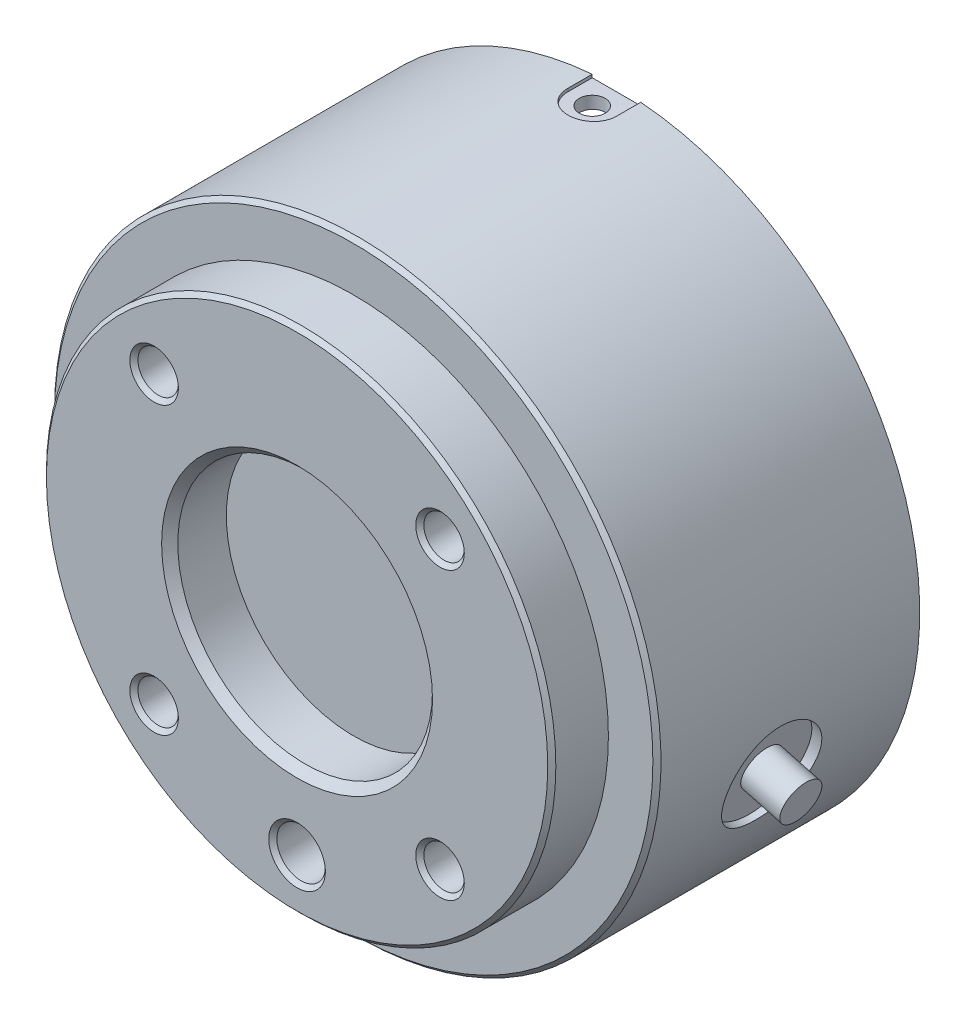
ISO-10303-21;
HEADER;
FILE_DESCRIPTION(('STEP AP214'),'2;1');
FILE_NAME('part.step','',(''),(''),'','','');
FILE_SCHEMA(('AUTOMOTIVE_DESIGN { 1 0 10303 214 1 1 1 1 }'));
ENDSEC;
DATA;
#1=APPLICATION_CONTEXT('core data for automotive mechanical design processes');
#2=APPLICATION_PROTOCOL_DEFINITION('international standard','automotive_design',2000,#1);
#3=PRODUCT_CONTEXT('',#1,'mechanical');
#4=PRODUCT('Part','Part','',(#3));
#5=PRODUCT_RELATED_PRODUCT_CATEGORY('part','',(#4));
#6=PRODUCT_DEFINITION_FORMATION('','',#4);
#7=PRODUCT_DEFINITION_CONTEXT('part definition',#1,'design');
#8=PRODUCT_DEFINITION('design','',#6,#7);
#9=PRODUCT_DEFINITION_SHAPE('','',#8);
#10=(LENGTH_UNIT() NAMED_UNIT(*) SI_UNIT(.MILLI.,.METRE.));
#11=(NAMED_UNIT(*) PLANE_ANGLE_UNIT() SI_UNIT($,.RADIAN.));
#12=(NAMED_UNIT(*) SI_UNIT($,.STERADIAN.) SOLID_ANGLE_UNIT());
#13=UNCERTAINTY_MEASURE_WITH_UNIT(LENGTH_MEASURE(1.E-05),#10,'distance_accuracy_value','');
#14=(GEOMETRIC_REPRESENTATION_CONTEXT(3) GLOBAL_UNCERTAINTY_ASSIGNED_CONTEXT((#13)) GLOBAL_UNIT_ASSIGNED_CONTEXT((#10,
#11,#12)) REPRESENTATION_CONTEXT('',''));
#15=CARTESIAN_POINT('',(0.,0.,0.));
#16=DIRECTION('',(0.,0.,1.));
#17=DIRECTION('',(1.,0.,0.));
#18=AXIS2_PLACEMENT_3D('',#15,#16,#17);
#19=CARTESIAN_POINT('',(0.,-25.,34.7));
#20=DIRECTION('',(0.,0.,1.));
#21=DIRECTION('',(1.,0.,0.));
#22=AXIS2_PLACEMENT_3D('',#19,#20,#21);
#23=PLANE('',#22);
#24=CARTESIAN_POINT('',(0.,-25.,34.7));
#25=DIRECTION('',(0.,0.,1.));
#26=DIRECTION('',(-1.,0.,0.));
#27=AXIS2_PLACEMENT_3D('',#24,#25,#26);
#28=CIRCLE('',#27,3.);
#29=CARTESIAN_POINT('',(-3.,-25.,34.7));
#30=VERTEX_POINT('',#29);
#31=EDGE_CURVE('E11',#30,#30,#28,.T.);
#32=ORIENTED_EDGE('',*,*,#31,.T.);
#33=EDGE_LOOP('',(#32));
#34=FACE_BOUND('',#33,.T.);
#35=ADVANCED_FACE('F16',(#34),#23,.T.);
#36=CARTESIAN_POINT('',(-17.6776695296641,-17.6776695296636,34.7));
#37=DIRECTION('',(0.,0.,1.));
#38=DIRECTION('',(1.,0.,0.));
#39=AXIS2_PLACEMENT_3D('',#36,#37,#38);
#40=PLANE('',#39);
#41=CARTESIAN_POINT('',(-17.6776695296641,-17.6776695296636,34.7));
#42=DIRECTION('',(0.,0.,1.));
#43=DIRECTION('',(-1.,0.,0.));
#44=AXIS2_PLACEMENT_3D('',#41,#42,#43);
#45=CIRCLE('',#44,2.49999999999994);
#46=CARTESIAN_POINT('',(-20.177669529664,-17.6776695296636,34.7));
#47=VERTEX_POINT('',#46);
#48=EDGE_CURVE('E31',#47,#47,#45,.T.);
#49=ORIENTED_EDGE('',*,*,#48,.T.);
#50=EDGE_LOOP('',(#49));
#51=FACE_BOUND('',#50,.T.);
#52=ADVANCED_FACE('F477',(#51),#40,.T.);
#53=CARTESIAN_POINT('',(17.677669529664,-17.6776695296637,34.7));
#54=DIRECTION('',(0.,0.,1.));
#55=DIRECTION('',(1.,0.,0.));
#56=AXIS2_PLACEMENT_3D('',#53,#54,#55);
#57=PLANE('',#56);
#58=CARTESIAN_POINT('',(17.677669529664,-17.6776695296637,34.7));
#59=DIRECTION('',(0.,0.,1.));
#60=DIRECTION('',(-1.,0.,0.));
#61=AXIS2_PLACEMENT_3D('',#58,#59,#60);
#62=CIRCLE('',#61,2.49999999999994);
#63=CARTESIAN_POINT('',(15.1776695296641,-17.6776695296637,34.7));
#64=VERTEX_POINT('',#63);
#65=EDGE_CURVE('E339',#64,#64,#62,.T.);
#66=ORIENTED_EDGE('',*,*,#65,.T.);
#67=EDGE_LOOP('',(#66));
#68=FACE_BOUND('',#67,.T.);
#69=ADVANCED_FACE('F474',(#68),#57,.T.);
#70=CARTESIAN_POINT('',(17.677669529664,17.6776695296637,34.7));
#71=DIRECTION('',(0.,0.,1.));
#72=DIRECTION('',(1.,0.,0.));
#73=AXIS2_PLACEMENT_3D('',#70,#71,#72);
#74=PLANE('',#73);
#75=CARTESIAN_POINT('',(17.677669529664,17.6776695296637,34.7));
#76=DIRECTION('',(0.,0.,1.));
#77=DIRECTION('',(-1.,0.,0.));
#78=AXIS2_PLACEMENT_3D('',#75,#76,#77);
#79=CIRCLE('',#78,2.49999999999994);
#80=CARTESIAN_POINT('',(15.1776695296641,17.6776695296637,34.7));
#81=VERTEX_POINT('',#80);
#82=EDGE_CURVE('E335',#81,#81,#79,.T.);
#83=ORIENTED_EDGE('',*,*,#82,.T.);
#84=EDGE_LOOP('',(#83));
#85=FACE_BOUND('',#84,.T.);
#86=ADVANCED_FACE('F470',(#85),#74,.T.);
#87=CARTESIAN_POINT('',(-17.6776695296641,17.6776695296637,34.7));
#88=DIRECTION('',(0.,0.,1.));
#89=DIRECTION('',(1.,0.,0.));
#90=AXIS2_PLACEMENT_3D('',#87,#88,#89);
#91=PLANE('',#90);
#92=CARTESIAN_POINT('',(-17.6776695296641,17.6776695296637,34.7));
#93=DIRECTION('',(0.,0.,1.));
#94=DIRECTION('',(-1.,0.,0.));
#95=AXIS2_PLACEMENT_3D('',#92,#93,#94);
#96=CIRCLE('',#95,2.49999999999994);
#97=CARTESIAN_POINT('',(-20.177669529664,17.6776695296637,34.7));
#98=VERTEX_POINT('',#97);
#99=EDGE_CURVE('E331',#98,#98,#96,.T.);
#100=ORIENTED_EDGE('',*,*,#99,.T.);
#101=EDGE_LOOP('',(#100));
#102=FACE_BOUND('',#101,.T.);
#103=ADVANCED_FACE('F466',(#102),#91,.T.);
#104=CARTESIAN_POINT('',(0.,0.,34.2));
#105=DIRECTION('',(0.,0.,1.));
#106=DIRECTION('',(1.,0.,0.));
#107=AXIS2_PLACEMENT_3D('',#104,#105,#106);
#108=PLANE('',#107);
#109=CARTESIAN_POINT('',(0.,0.,34.2));
#110=DIRECTION('',(0.,0.,1.));
#111=DIRECTION('',(1.,0.,0.));
#112=AXIS2_PLACEMENT_3D('',#109,#110,#111);
#113=CIRCLE('',#112,15.75);
#114=CARTESIAN_POINT('',(15.75,0.,34.2));
#115=VERTEX_POINT('',#114);
#116=EDGE_CURVE('E330',#115,#115,#113,.T.);
#117=ORIENTED_EDGE('',*,*,#116,.T.);
#118=EDGE_LOOP('',(#117));
#119=FACE_BOUND('',#118,.T.);
#120=ADVANCED_FACE('F462',(#119),#108,.T.);
#121=CARTESIAN_POINT('',(0.,-25.,41.2));
#122=DIRECTION('',(0.,0.,-1.));
#123=DIRECTION('',(-1.,0.,0.));
#124=AXIS2_PLACEMENT_3D('',#121,#122,#123);
#125=CYLINDRICAL_SURFACE('',#124,3.);
#126=ORIENTED_EDGE('',*,*,#31,.F.);
#127=EDGE_LOOP('',(#126));
#128=FACE_BOUND('',#127,.T.);
#129=CARTESIAN_POINT('',(0.,-25.,40.7000000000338));
#130=DIRECTION('',(0.,0.,1.));
#131=DIRECTION('',(-1.,0.,0.));
#132=AXIS2_PLACEMENT_3D('',#129,#130,#131);
#133=CIRCLE('',#132,2.99999999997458);
#134=CARTESIAN_POINT('',(-2.99999999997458,-25.,40.7000000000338));
#135=VERTEX_POINT('',#134);
#136=EDGE_CURVE('E326',#135,#135,#133,.T.);
#137=ORIENTED_EDGE('',*,*,#136,.T.);
#138=EDGE_LOOP('',(#137));
#139=FACE_BOUND('',#138,.T.);
#140=ADVANCED_FACE('F458',(#128,#139),#125,.F.);
#141=CARTESIAN_POINT('',(-17.6776695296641,-17.6776695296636,41.2));
#142=DIRECTION('',(0.,0.,-1.));
#143=DIRECTION('',(-1.,0.,0.));
#144=AXIS2_PLACEMENT_3D('',#141,#142,#143);
#145=CYLINDRICAL_SURFACE('',#144,2.49999999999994);
#146=ORIENTED_EDGE('',*,*,#48,.F.);
#147=EDGE_LOOP('',(#146));
#148=FACE_BOUND('',#147,.T.);
#149=CARTESIAN_POINT('',(-17.6776695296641,-17.6776695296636,40.6999999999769));
#150=DIRECTION('',(0.,0.,1.));
#151=DIRECTION('',(-1.,0.,0.));
#152=AXIS2_PLACEMENT_3D('',#149,#150,#151);
#153=CIRCLE('',#152,2.50000000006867);
#154=CARTESIAN_POINT('',(-20.1776695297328,-17.6776695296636,40.6999999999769));
#155=VERTEX_POINT('',#154);
#156=EDGE_CURVE('E322',#155,#155,#153,.T.);
#157=ORIENTED_EDGE('',*,*,#156,.T.);
#158=EDGE_LOOP('',(#157));
#159=FACE_BOUND('',#158,.T.);
#160=ADVANCED_FACE('F454',(#148,#159),#145,.F.);
#161=CARTESIAN_POINT('',(17.677669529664,-17.6776695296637,41.2));
#162=DIRECTION('',(0.,0.,-1.));
#163=DIRECTION('',(-1.,0.,0.));
#164=AXIS2_PLACEMENT_3D('',#161,#162,#163);
#165=CYLINDRICAL_SURFACE('',#164,2.49999999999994);
#166=ORIENTED_EDGE('',*,*,#65,.F.);
#167=EDGE_LOOP('',(#166));
#168=FACE_BOUND('',#167,.T.);
#169=CARTESIAN_POINT('',(17.677669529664,-17.6776695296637,40.6999999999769));
#170=DIRECTION('',(0.,0.,1.));
#171=DIRECTION('',(-1.,0.,0.));
#172=AXIS2_PLACEMENT_3D('',#169,#170,#171);
#173=CIRCLE('',#172,2.50000000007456);
#174=CARTESIAN_POINT('',(15.1776695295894,-17.6776695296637,40.6999999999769));
#175=VERTEX_POINT('',#174);
#176=EDGE_CURVE('E318',#175,#175,#173,.T.);
#177=ORIENTED_EDGE('',*,*,#176,.T.);
#178=EDGE_LOOP('',(#177));
#179=FACE_BOUND('',#178,.T.);
#180=ADVANCED_FACE('F450',(#168,#179),#165,.F.);
#181=CARTESIAN_POINT('',(17.677669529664,17.6776695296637,41.2));
#182=DIRECTION('',(0.,0.,-1.));
#183=DIRECTION('',(-1.,0.,0.));
#184=AXIS2_PLACEMENT_3D('',#181,#182,#183);
#185=CYLINDRICAL_SURFACE('',#184,2.49999999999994);
#186=ORIENTED_EDGE('',*,*,#82,.F.);
#187=EDGE_LOOP('',(#186));
#188=FACE_BOUND('',#187,.T.);
#189=CARTESIAN_POINT('',(17.677669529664,17.6776695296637,40.6999999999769));
#190=DIRECTION('',(0.,0.,1.));
#191=DIRECTION('',(-1.,0.,0.));
#192=AXIS2_PLACEMENT_3D('',#189,#190,#191);
#193=CIRCLE('',#192,2.50000000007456);
#194=CARTESIAN_POINT('',(15.1776695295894,17.6776695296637,40.6999999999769));
#195=VERTEX_POINT('',#194);
#196=EDGE_CURVE('E311',#195,#195,#193,.T.);
#197=ORIENTED_EDGE('',*,*,#196,.T.);
#198=EDGE_LOOP('',(#197));
#199=FACE_BOUND('',#198,.T.);
#200=ADVANCED_FACE('F446',(#188,#199),#185,.F.);
#201=CARTESIAN_POINT('',(-17.6776695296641,17.6776695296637,41.2));
#202=DIRECTION('',(0.,0.,-1.));
#203=DIRECTION('',(-1.,0.,0.));
#204=AXIS2_PLACEMENT_3D('',#201,#202,#203);
#205=CYLINDRICAL_SURFACE('',#204,2.49999999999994);
#206=ORIENTED_EDGE('',*,*,#99,.F.);
#207=EDGE_LOOP('',(#206));
#208=FACE_BOUND('',#207,.T.);
#209=CARTESIAN_POINT('',(-17.6776695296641,17.6776695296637,40.6999999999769));
#210=DIRECTION('',(0.,0.,1.));
#211=DIRECTION('',(-1.,0.,0.));
#212=AXIS2_PLACEMENT_3D('',#209,#210,#211);
#213=CIRCLE('',#212,2.50000000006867);
#214=CARTESIAN_POINT('',(-20.1776695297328,17.6776695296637,40.6999999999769));
#215=VERTEX_POINT('',#214);
#216=EDGE_CURVE('E307',#215,#215,#213,.T.);
#217=ORIENTED_EDGE('',*,*,#216,.T.);
#218=EDGE_LOOP('',(#217));
#219=FACE_BOUND('',#218,.T.);
#220=ADVANCED_FACE('F442',(#208,#219),#205,.F.);
#221=CARTESIAN_POINT('',(0.,0.,41.2));
#222=DIRECTION('',(0.,0.,-1.));
#223=DIRECTION('',(-1.,0.,0.));
#224=AXIS2_PLACEMENT_3D('',#221,#222,#223);
#225=CYLINDRICAL_SURFACE('',#224,15.75);
#226=ORIENTED_EDGE('',*,*,#116,.F.);
#227=EDGE_LOOP('',(#226));
#228=FACE_BOUND('',#227,.T.);
#229=CARTESIAN_POINT('',(0.,0.,40.2));
#230=DIRECTION('',(0.,0.,1.));
#231=DIRECTION('',(1.,0.,0.));
#232=AXIS2_PLACEMENT_3D('',#229,#230,#231);
#233=CIRCLE('',#232,15.75);
#234=CARTESIAN_POINT('',(15.75,0.,40.2));
#235=VERTEX_POINT('',#234);
#236=EDGE_CURVE('E224',#235,#235,#233,.T.);
#237=ORIENTED_EDGE('',*,*,#236,.T.);
#238=EDGE_LOOP('',(#237));
#239=FACE_BOUND('',#238,.T.);
#240=ADVANCED_FACE('F438',(#228,#239),#225,.F.);
#241=CARTESIAN_POINT('',(0.,-25.,41.2000000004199));
#242=DIRECTION('',(0.,0.,1.));
#243=DIRECTION('',(1.,0.,0.));
#244=AXIS2_PLACEMENT_3D('',#241,#242,#243);
#245=CONICAL_SURFACE('',#244,3.49999999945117,0.785398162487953);
#246=ORIENTED_EDGE('',*,*,#136,.F.);
#247=EDGE_LOOP('',(#246));
#248=FACE_BOUND('',#247,.T.);
#249=CARTESIAN_POINT('',(0.,-25.,41.2000000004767));
#250=DIRECTION('',(0.,0.,-1.));
#251=DIRECTION('',(1.,0.,0.));
#252=AXIS2_PLACEMENT_3D('',#249,#250,#251);
#253=CIRCLE('',#252,3.49999999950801);
#254=CARTESIAN_POINT('',(3.49999999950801,-25.,41.2000000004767));
#255=VERTEX_POINT('',#254);
#256=EDGE_CURVE('E296',#255,#255,#253,.T.);
#257=ORIENTED_EDGE('',*,*,#256,.F.);
#258=EDGE_LOOP('',(#257));
#259=FACE_BOUND('',#258,.T.);
#260=ADVANCED_FACE('F434',(#248,#259),#245,.F.);
#261=CARTESIAN_POINT('',(-17.6776695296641,-17.6776695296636,41.2000000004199));
#262=DIRECTION('',(0.,0.,1.));
#263=DIRECTION('',(1.,0.,0.));
#264=AXIS2_PLACEMENT_3D('',#261,#262,#263);
#265=CONICAL_SURFACE('',#264,2.9999999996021,0.785398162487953);
#266=ORIENTED_EDGE('',*,*,#156,.F.);
#267=EDGE_LOOP('',(#266));
#268=FACE_BOUND('',#267,.T.);
#269=CARTESIAN_POINT('',(-17.6776695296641,-17.6776695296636,41.2000000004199));
#270=DIRECTION('',(0.,0.,-1.));
#271=DIRECTION('',(1.,0.,0.));
#272=AXIS2_PLACEMENT_3D('',#269,#270,#271);
#273=CIRCLE('',#272,2.9999999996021);
#274=CARTESIAN_POINT('',(-14.677669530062,-17.6776695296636,41.2000000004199));
#275=VERTEX_POINT('',#274);
#276=EDGE_CURVE('E300',#275,#275,#273,.T.);
#277=ORIENTED_EDGE('',*,*,#276,.F.);
#278=EDGE_LOOP('',(#277));
#279=FACE_BOUND('',#278,.T.);
#280=ADVANCED_FACE('F430',(#268,#279),#265,.F.);
#281=CARTESIAN_POINT('',(17.677669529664,-17.6776695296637,41.2000000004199));
#282=DIRECTION('',(0.,0.,1.));
#283=DIRECTION('',(1.,0.,0.));
#284=AXIS2_PLACEMENT_3D('',#281,#282,#283);
#285=CONICAL_SURFACE('',#284,2.99999999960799,0.785398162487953);
#286=ORIENTED_EDGE('',*,*,#176,.F.);
#287=EDGE_LOOP('',(#286));
#288=FACE_BOUND('',#287,.T.);
#289=CARTESIAN_POINT('',(17.677669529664,-17.6776695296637,41.2000000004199));
#290=DIRECTION('',(0.,0.,-1.));
#291=DIRECTION('',(1.,0.,0.));
#292=AXIS2_PLACEMENT_3D('',#289,#290,#291);
#293=CIRCLE('',#292,2.99999999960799);
#294=CARTESIAN_POINT('',(20.677669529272,-17.6776695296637,41.2000000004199));
#295=VERTEX_POINT('',#294);
#296=EDGE_CURVE('E225',#295,#295,#293,.T.);
#297=ORIENTED_EDGE('',*,*,#296,.F.);
#298=EDGE_LOOP('',(#297));
#299=FACE_BOUND('',#298,.T.);
#300=ADVANCED_FACE('F426',(#288,#299),#285,.F.);
#301=CARTESIAN_POINT('',(17.677669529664,17.6776695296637,41.2000000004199));
#302=DIRECTION('',(0.,0.,1.));
#303=DIRECTION('',(1.,0.,0.));
#304=AXIS2_PLACEMENT_3D('',#301,#302,#303);
#305=CONICAL_SURFACE('',#304,2.99999999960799,0.785398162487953);
#306=ORIENTED_EDGE('',*,*,#196,.F.);
#307=EDGE_LOOP('',(#306));
#308=FACE_BOUND('',#307,.T.);
#309=CARTESIAN_POINT('',(17.677669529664,17.6776695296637,41.2000000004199));
#310=DIRECTION('',(0.,0.,-1.));
#311=DIRECTION('',(1.,0.,0.));
#312=AXIS2_PLACEMENT_3D('',#309,#310,#311);
#313=CIRCLE('',#312,2.99999999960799);
#314=CARTESIAN_POINT('',(20.677669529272,17.6776695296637,41.2000000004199));
#315=VERTEX_POINT('',#314);
#316=EDGE_CURVE('E220',#315,#315,#313,.T.);
#317=ORIENTED_EDGE('',*,*,#316,.F.);
#318=EDGE_LOOP('',(#317));
#319=FACE_BOUND('',#318,.T.);
#320=ADVANCED_FACE('F422',(#308,#319),#305,.F.);
#321=CARTESIAN_POINT('',(-17.6776695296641,17.6776695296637,41.2000000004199));
#322=DIRECTION('',(0.,0.,1.));
#323=DIRECTION('',(1.,0.,0.));
#324=AXIS2_PLACEMENT_3D('',#321,#322,#323);
#325=CONICAL_SURFACE('',#324,2.9999999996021,0.785398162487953);
#326=ORIENTED_EDGE('',*,*,#216,.F.);
#327=EDGE_LOOP('',(#326));
#328=FACE_BOUND('',#327,.T.);
#329=CARTESIAN_POINT('',(-17.6776695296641,17.6776695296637,41.2000000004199));
#330=DIRECTION('',(0.,0.,-1.));
#331=DIRECTION('',(1.,0.,0.));
#332=AXIS2_PLACEMENT_3D('',#329,#330,#331);
#333=CIRCLE('',#332,2.9999999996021);
#334=CARTESIAN_POINT('',(-14.677669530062,17.6776695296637,41.2000000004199));
#335=VERTEX_POINT('',#334);
#336=EDGE_CURVE('E530',#335,#335,#333,.T.);
#337=ORIENTED_EDGE('',*,*,#336,.F.);
#338=EDGE_LOOP('',(#337));
#339=FACE_BOUND('',#338,.T.);
#340=ADVANCED_FACE('F418',(#328,#339),#325,.F.);
#341=CARTESIAN_POINT('',(0.,0.,41.2));
#342=DIRECTION('',(0.,0.,1.));
#343=DIRECTION('',(1.,0.,0.));
#344=AXIS2_PLACEMENT_3D('',#341,#342,#343);
#345=CONICAL_SURFACE('',#344,16.75,0.785398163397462);
#346=ORIENTED_EDGE('',*,*,#236,.F.);
#347=EDGE_LOOP('',(#346));
#348=FACE_BOUND('',#347,.T.);
#349=CARTESIAN_POINT('',(0.,0.,41.2));
#350=DIRECTION('',(0.,0.,-1.));
#351=DIRECTION('',(1.,0.,0.));
#352=AXIS2_PLACEMENT_3D('',#349,#350,#351);
#353=CIRCLE('',#352,16.75);
#354=CARTESIAN_POINT('',(16.75,0.,41.2));
#355=VERTEX_POINT('',#354);
#356=EDGE_CURVE('E531',#355,#355,#353,.T.);
#357=ORIENTED_EDGE('',*,*,#356,.F.);
#358=EDGE_LOOP('',(#357));
#359=FACE_BOUND('',#358,.T.);
#360=ADVANCED_FACE('F374',(#348,#359),#345,.F.);
#361=CARTESIAN_POINT('',(39.79614404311,-10.6633446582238,18.7));
#362=DIRECTION('',(0.965925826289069,-0.258819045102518,0.));
#363=DIRECTION('',(0.,0.,-1.));
#364=AXIS2_PLACEMENT_3D('',#361,#362,#363);
#365=PLANE('',#364);
#366=CARTESIAN_POINT('',(39.79614404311,-10.6633446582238,18.7));
#367=DIRECTION('',(0.965925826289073,-0.258819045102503,0.));
#368=DIRECTION('',(0.258819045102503,0.965925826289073,0.));
#369=AXIS2_PLACEMENT_3D('',#366,#367,#368);
#370=CIRCLE('',#369,2.52499999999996);
#371=CARTESIAN_POINT('',(40.4496621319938,-8.22438194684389,18.7));
#372=VERTEX_POINT('',#371);
#373=EDGE_CURVE('E248',#372,#372,#370,.T.);
#374=ORIENTED_EDGE('',*,*,#373,.T.);
#375=EDGE_LOOP('',(#374));
#376=FACE_BOUND('',#375,.T.);
#377=ADVANCED_FACE('F369',(#376),#365,.T.);
#378=CARTESIAN_POINT('',(0.,0.,40.6999999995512));
#379=DIRECTION('',(0.,0.,-1.));
#380=DIRECTION('',(-1.,0.,0.));
#381=AXIS2_PLACEMENT_3D('',#378,#379,#380);
#382=CONICAL_SURFACE('',#381,31.4999999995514,0.7853981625);
#383=CARTESIAN_POINT('',(0.,0.,41.2));
#384=DIRECTION('',(0.,0.,-1.));
#385=DIRECTION('',(-1.,0.,0.));
#386=AXIS2_PLACEMENT_3D('',#383,#384,#385);
#387=CIRCLE('',#386,31.);
#388=CARTESIAN_POINT('',(-31.,0.,41.2));
#389=VERTEX_POINT('',#388);
#390=EDGE_CURVE('E527',#389,#389,#387,.T.);
#391=ORIENTED_EDGE('',*,*,#390,.T.);
#392=EDGE_LOOP('',(#391));
#393=FACE_BOUND('',#392,.T.);
#394=CARTESIAN_POINT('',(0.,0.,40.7));
#395=DIRECTION('',(0.,0.,-1.));
#396=DIRECTION('',(1.,0.,0.));
#397=AXIS2_PLACEMENT_3D('',#394,#395,#396);
#398=CIRCLE('',#397,31.5);
#399=CARTESIAN_POINT('',(31.5,0.,40.7));
#400=VERTEX_POINT('',#399);
#401=EDGE_CURVE('E200',#400,#400,#398,.T.);
#402=ORIENTED_EDGE('',*,*,#401,.F.);
#403=EDGE_LOOP('',(#402));
#404=FACE_BOUND('',#403,.T.);
#405=ADVANCED_FACE('F373',(#393,#404),#382,.T.);
#406=CARTESIAN_POINT('',(34.0005890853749,-9.11043038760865,18.7));
#407=DIRECTION('',(0.965925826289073,-0.258819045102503,0.));
#408=DIRECTION('',(0.258819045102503,0.965925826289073,0.));
#409=AXIS2_PLACEMENT_3D('',#406,#407,#408);
#410=CYLINDRICAL_SURFACE('',#409,2.52499999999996);
#411=ORIENTED_EDGE('',*,*,#373,.F.);
#412=EDGE_LOOP('',(#411));
#413=FACE_BOUND('',#412,.T.);
#414=CARTESIAN_POINT('',(34.9665149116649,-9.36924943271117,18.7));
#415=DIRECTION('',(0.965925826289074,-0.258819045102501,0.));
#416=DIRECTION('',(0.258819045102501,0.965925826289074,0.));
#417=AXIS2_PLACEMENT_3D('',#414,#415,#416);
#418=CIRCLE('',#417,2.525);
#419=CARTESIAN_POINT('',(35.6200330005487,-6.93028672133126,18.7));
#420=VERTEX_POINT('',#419);
#421=EDGE_CURVE('E196',#420,#420,#418,.T.);
#422=ORIENTED_EDGE('',*,*,#421,.T.);
#423=EDGE_LOOP('',(#422));
#424=FACE_BOUND('',#423,.T.);
#425=ADVANCED_FACE('F408',(#413,#424),#410,.T.);
#426=CARTESIAN_POINT('',(0.,0.,34.2));
#427=DIRECTION('',(0.,0.,1.));
#428=DIRECTION('',(1.,0.,0.));
#429=AXIS2_PLACEMENT_3D('',#426,#427,#428);
#430=CYLINDRICAL_SURFACE('',#429,31.5);
#431=CARTESIAN_POINT('',(0.,0.,34.2));
#432=DIRECTION('',(0.,0.,1.));
#433=DIRECTION('',(1.,0.,0.));
#434=AXIS2_PLACEMENT_3D('',#431,#432,#433);
#435=CIRCLE('',#434,31.5);
#436=CARTESIAN_POINT('',(31.5,0.,34.2));
#437=VERTEX_POINT('',#436);
#438=EDGE_CURVE('E201',#437,#437,#435,.T.);
#439=ORIENTED_EDGE('',*,*,#438,.T.);
#440=EDGE_LOOP('',(#439));
#441=FACE_BOUND('',#440,.T.);
#442=ORIENTED_EDGE('',*,*,#401,.T.);
#443=EDGE_LOOP('',(#442));
#444=FACE_BOUND('',#443,.T.);
#445=ADVANCED_FACE('F404',(#441,#444),#430,.T.);
#446=CARTESIAN_POINT('',(34.9665149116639,-9.36924943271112,18.7));
#447=DIRECTION('',(-0.965925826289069,0.258819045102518,0.));
#448=DIRECTION('',(0.,0.,1.));
#449=AXIS2_PLACEMENT_3D('',#446,#447,#448);
#450=PLANE('',#449);
#451=ORIENTED_EDGE('',*,*,#421,.F.);
#452=EDGE_LOOP('',(#451));
#453=FACE_BOUND('',#452,.T.);
#454=CARTESIAN_POINT('',(34.9665149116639,-9.36924943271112,18.7));
#455=DIRECTION('',(-0.965925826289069,0.258819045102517,0.));
#456=DIRECTION('',(-0.258819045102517,-0.965925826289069,0.));
#457=AXIS2_PLACEMENT_3D('',#454,#455,#456);
#458=CIRCLE('',#457,6.);
#459=CARTESIAN_POINT('',(33.4136006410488,-15.1648043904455,18.7));
#460=VERTEX_POINT('',#459);
#461=EDGE_CURVE('E286',#460,#460,#458,.T.);
#462=ORIENTED_EDGE('',*,*,#461,.F.);
#463=EDGE_LOOP('',(#462));
#464=FACE_BOUND('',#463,.T.);
#465=ADVANCED_FACE('F400',(#453,#464),#450,.F.);
#466=CARTESIAN_POINT('',(0.,0.,34.2));
#467=DIRECTION('',(0.,0.,-1.));
#468=DIRECTION('',(0.,-1.,0.));
#469=AXIS2_PLACEMENT_3D('',#466,#467,#468);
#470=PLANE('',#469);
#471=ORIENTED_EDGE('',*,*,#438,.F.);
#472=EDGE_LOOP('',(#471));
#473=FACE_BOUND('',#472,.T.);
#474=CARTESIAN_POINT('',(0.,0.,34.2));
#475=DIRECTION('',(0.,0.,1.));
#476=DIRECTION('',(-1.,0.,0.));
#477=AXIS2_PLACEMENT_3D('',#474,#475,#476);
#478=CIRCLE('',#477,37.);
#479=CARTESIAN_POINT('',(-37.,0.,34.2));
#480=VERTEX_POINT('',#479);
#481=EDGE_CURVE('E282',#480,#480,#478,.T.);
#482=ORIENTED_EDGE('',*,*,#481,.T.);
#483=EDGE_LOOP('',(#482));
#484=FACE_BOUND('',#483,.T.);
#485=ADVANCED_FACE('F397',(#473,#484),#470,.F.);
#486=CARTESIAN_POINT('',(44.625773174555,-11.9574398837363,18.7));
#487=DIRECTION('',(-0.965925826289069,0.258819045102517,0.));
#488=DIRECTION('',(-0.258819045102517,-0.965925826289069,0.));
#489=AXIS2_PLACEMENT_3D('',#486,#487,#488);
#490=CYLINDRICAL_SURFACE('',#489,6.);
#491=CARTESIAN_POINT('',(34.2026538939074,-15.376230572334,18.7));
#492=CARTESIAN_POINT('',(34.2026522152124,-15.3762326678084,18.8674077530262));
#493=CARTESIAN_POINT('',(34.2055669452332,-15.3697553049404,19.034781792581));
#494=CARTESIAN_POINT('',(34.217176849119,-15.343892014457,19.3683795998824));
#495=CARTESIAN_POINT('',(34.2258731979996,-15.3245034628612,19.534603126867));
#496=CARTESIAN_POINT('',(34.2489199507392,-15.2729262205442,19.8647613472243));
#497=CARTESIAN_POINT('',(34.2632740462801,-15.2407291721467,20.0286944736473));
#498=CARTESIAN_POINT('',(34.2974180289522,-15.1637359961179,20.3530617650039));
#499=CARTESIAN_POINT('',(34.317209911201,-15.1189352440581,20.5134946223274));
#500=CARTESIAN_POINT('',(34.3618970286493,-15.0170941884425,20.8294810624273));
#501=CARTESIAN_POINT('',(34.3867861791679,-14.9600684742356,20.9850402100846));
#502=CARTESIAN_POINT('',(34.4413193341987,-14.8340902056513,21.2904564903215));
#503=CARTESIAN_POINT('',(34.4709650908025,-14.7651332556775,21.4403114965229));
#504=CARTESIAN_POINT('',(34.5345553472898,-14.6157814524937,21.7331568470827));
#505=CARTESIAN_POINT('',(34.568497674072,-14.5353923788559,21.8761506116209));
#506=CARTESIAN_POINT('',(34.6402237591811,-14.363619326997,22.1544349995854));
#507=CARTESIAN_POINT('',(34.6780089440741,-14.272231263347,22.2897227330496));
#508=CARTESIAN_POINT('',(34.7571956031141,-14.0782955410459,22.5526419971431));
#509=CARTESIAN_POINT('',(34.7986228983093,-13.9756666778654,22.6802058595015));
#510=CARTESIAN_POINT('',(34.8842915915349,-13.7604366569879,22.9256936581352));
#511=CARTESIAN_POINT('',(34.9285340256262,-13.6478318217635,23.0436140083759));
#512=CARTESIAN_POINT('',(35.0192229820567,-13.4134188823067,23.2689143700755));
#513=CARTESIAN_POINT('',(35.0656688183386,-13.291613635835,23.3762976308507));
#514=CARTESIAN_POINT('',(35.1602039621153,-13.0394856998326,23.5798547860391));
#515=CARTESIAN_POINT('',(35.2082938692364,-12.90915988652,23.6760245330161));
#516=CARTESIAN_POINT('',(35.3057606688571,-12.6401671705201,23.8568921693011));
#517=CARTESIAN_POINT('',(35.3551429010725,-12.5014608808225,23.9415286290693));
#518=CARTESIAN_POINT('',(35.4543837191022,-12.2171745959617,24.0981560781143));
#519=CARTESIAN_POINT('',(35.5042424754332,-12.071592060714,24.17014234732));
#520=CARTESIAN_POINT('',(35.6038318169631,-11.7746187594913,24.300869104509));
#521=CARTESIAN_POINT('',(35.6535624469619,-11.6232304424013,24.3596151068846));
#522=CARTESIAN_POINT('',(35.7523818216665,-11.3156257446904,24.4634716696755));
#523=CARTESIAN_POINT('',(35.8014703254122,-11.1594076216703,24.5085772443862));
#524=CARTESIAN_POINT('',(35.9461398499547,-10.6879311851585,24.622153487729));
#525=CARTESIAN_POINT('',(36.0400995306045,-10.3669620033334,24.6701510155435));
#526=CARTESIAN_POINT('',(36.2200634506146,-9.71957194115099,24.7094268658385));
#527=CARTESIAN_POINT('',(36.3060681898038,-9.39315140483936,24.7007087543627));
#528=CARTESIAN_POINT('',(36.4670813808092,-8.74709973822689,24.6272499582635));
#529=CARTESIAN_POINT('',(36.5421830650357,-8.42743382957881,24.5630215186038));
#530=CARTESIAN_POINT('',(36.6809992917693,-7.80110786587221,24.3811506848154));
#531=CARTESIAN_POINT('',(36.7447135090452,-7.4944481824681,24.2635067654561));
#532=CARTESIAN_POINT('',(36.8606606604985,-6.90169351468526,23.9776342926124));
#533=CARTESIAN_POINT('',(36.9128436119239,-6.6156915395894,23.8091927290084));
#534=CARTESIAN_POINT('',(37.0058458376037,-6.07396370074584,23.4266608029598));
#535=CARTESIAN_POINT('',(37.0466642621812,-5.8182401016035,23.2125670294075));
#536=CARTESIAN_POINT('',(37.1183648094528,-5.34188859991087,22.7419612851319));
#537=CARTESIAN_POINT('',(37.1491306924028,-5.12168521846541,22.4850016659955));
#538=CARTESIAN_POINT('',(37.2014633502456,-4.72662253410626,21.9374717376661));
#539=CARTESIAN_POINT('',(37.2230300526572,-4.55176358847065,21.6469011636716));
#540=CARTESIAN_POINT('',(37.2583727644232,-4.25281673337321,21.0399084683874));
#541=CARTESIAN_POINT('',(37.2721411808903,-4.12877833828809,20.7234614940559));
#542=CARTESIAN_POINT('',(37.2930065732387,-3.93588164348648,20.0739681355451));
#543=CARTESIAN_POINT('',(37.3001040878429,-3.86701888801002,19.7409230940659));
#544=CARTESIAN_POINT('',(37.3082836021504,-3.78729270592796,19.0716165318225));
#545=CARTESIAN_POINT('',(37.3094310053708,-3.77579873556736,18.7354308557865));
#546=CARTESIAN_POINT('',(37.3060046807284,-3.80950004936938,18.0659531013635));
#547=CARTESIAN_POINT('',(37.3014311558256,-3.85469332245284,17.7326609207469));
#548=CARTESIAN_POINT('',(37.286148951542,-3.99978914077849,17.0803992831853));
#549=CARTESIAN_POINT('',(37.2754758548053,-4.09937423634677,16.7613582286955));
#550=CARTESIAN_POINT('',(37.2470853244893,-4.34976035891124,16.1443888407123));
#551=CARTESIAN_POINT('',(37.2293674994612,-4.50056423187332,15.8464616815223));
#552=CARTESIAN_POINT('',(37.1854467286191,-4.85012684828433,15.2773828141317));
#553=CARTESIAN_POINT('',(37.159172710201,-5.04928358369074,15.0064811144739));
#554=CARTESIAN_POINT('',(37.0968002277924,-5.4887657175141,14.5017218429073));
#555=CARTESIAN_POINT('',(37.0607011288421,-5.72909377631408,14.2678666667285));
#556=CARTESIAN_POINT('',(36.9770672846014,-6.24624973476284,13.8415680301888));
#557=CARTESIAN_POINT('',(36.9294267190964,-6.52340399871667,13.6495409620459));
#558=CARTESIAN_POINT('',(36.8221121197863,-7.10416067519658,13.3152612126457));
#559=CARTESIAN_POINT('',(36.7624384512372,-7.40776228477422,13.173007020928));
#560=CARTESIAN_POINT('',(36.6313177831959,-8.03103777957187,12.9429605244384));
#561=CARTESIAN_POINT('',(36.5599202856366,-8.35064031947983,12.8549463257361));
#562=CARTESIAN_POINT('',(36.4060399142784,-8.99780780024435,12.7351833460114));
#563=CARTESIAN_POINT('',(36.323557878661,-9.32537213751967,12.7034303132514));
#564=CARTESIAN_POINT('',(36.1936458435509,-9.81316606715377,12.6986920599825));
#565=CARTESIAN_POINT('',(36.1495516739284,-9.97435540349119,12.7041257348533));
#566=CARTESIAN_POINT('',(36.0595081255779,-10.29512122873,12.7289039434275));
#567=CARTESIAN_POINT('',(36.0135594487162,-10.454698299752,12.7482432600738));
#568=CARTESIAN_POINT('',(35.9201748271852,-10.7711791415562,12.8007011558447));
#569=CARTESIAN_POINT('',(35.8727383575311,-10.9280819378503,12.8338246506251));
#570=CARTESIAN_POINT('',(35.7768487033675,-11.2380335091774,12.9135826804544));
#571=CARTESIAN_POINT('',(35.7283958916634,-11.3910836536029,12.9602123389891));
#572=CARTESIAN_POINT('',(35.630970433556,-11.6922618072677,13.0666087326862));
#573=CARTESIAN_POINT('',(35.5819981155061,-11.8403927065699,13.1263675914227));
#574=CARTESIAN_POINT('',(35.4840404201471,-12.1308018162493,13.2585774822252));
#575=CARTESIAN_POINT('',(35.4350550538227,-12.2730821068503,13.3310239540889));
#576=CARTESIAN_POINT('',(35.337578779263,-12.5509848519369,13.4881353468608));
#577=CARTESIAN_POINT('',(35.2890880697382,-12.6866047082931,13.5728049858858));
#578=CARTESIAN_POINT('',(35.1931998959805,-12.9502258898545,13.7537141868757));
#579=CARTESIAN_POINT('',(35.1458020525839,-13.0782298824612,13.8499496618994));
#580=CARTESIAN_POINT('',(35.0521411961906,-13.3272386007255,14.0544673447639));
#581=CARTESIAN_POINT('',(35.0058963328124,-13.4481511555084,14.1628701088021));
#582=CARTESIAN_POINT('',(34.9156951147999,-13.6806352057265,14.3900523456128));
#583=CARTESIAN_POINT('',(34.8717379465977,-13.7922100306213,14.508828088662));
#584=CARTESIAN_POINT('',(34.786647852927,-14.0054389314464,14.7560472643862));
#585=CARTESIAN_POINT('',(34.7455166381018,-14.1070870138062,14.8844964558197));
#586=CARTESIAN_POINT('',(34.6666826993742,-14.2997182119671,15.1500693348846));
#587=CARTESIAN_POINT('',(34.6289787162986,-14.3907052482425,15.2871898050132));
#588=CARTESIAN_POINT('',(34.557266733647,-14.5620742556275,15.5701754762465));
#589=CARTESIAN_POINT('',(34.5232858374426,-14.6423792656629,15.7160941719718));
#590=CARTESIAN_POINT('',(34.4598299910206,-14.7911004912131,16.0147378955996));
#591=CARTESIAN_POINT('',(34.430353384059,-14.8595210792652,16.1674603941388));
#592=CARTESIAN_POINT('',(34.3763547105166,-14.9840196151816,16.4785785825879));
#593=CARTESIAN_POINT('',(34.3518291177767,-15.0401063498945,16.6369701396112));
#594=CARTESIAN_POINT('',(34.3080900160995,-15.1396137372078,16.9583415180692));
#595=CARTESIAN_POINT('',(34.2888753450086,-15.1830371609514,17.1213203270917));
#596=CARTESIAN_POINT('',(34.2494469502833,-15.2718258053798,17.5171132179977));
#597=CARTESIAN_POINT('',(34.2319436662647,-15.3109385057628,17.7516338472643));
#598=CARTESIAN_POINT('',(34.2085484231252,-15.3631391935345,18.2241257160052));
#599=CARTESIAN_POINT('',(34.2026562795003,-15.3762275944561,18.4620969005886));
#600=CARTESIAN_POINT('',(34.2026538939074,-15.376230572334,18.7));
#601=B_SPLINE_CURVE_WITH_KNOTS('',3,(#491,#492,#493,#494,#495,#496,#497,#498,#499,#500,#501,
#502,#503,#504,#505,#506,#507,#508,#509,#510,#511,#512,#513,#514,#515,#516,#517,#518,#519,#520,
#521,#522,#523,#524,#525,#526,#527,#528,#529,#530,#531,#532,#533,#534,#535,#536,#537,#538,#539,
#540,#541,#542,#543,#544,#545,#546,#547,#548,#549,#550,#551,#552,#553,#554,#555,#556,#557,#558,
#559,#560,#561,#562,#563,#564,#565,#566,#567,#568,#569,#570,#571,#572,#573,#574,#575,#576,#577,
#578,#579,#580,#581,#582,#583,#584,#585,#586,#587,#588,#589,#590,#591,#592,#593,#594,#595,#596,
#597,#598,#599,#600),.UNSPECIFIED.,.T.,.F.,(4,2,2,2,2,2,2,2,2,2,2,2,2,2,2,2,2,2,2,2,2,2,2,2,2,2,
2,2,2,2,2,2,2,2,2,2,2,2,2,2,2,2,2,2,2,2,2,2,2,2,2,2,2,2,4),(0.,0.502014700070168,
1.00413145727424,1.50657638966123,2.00920591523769,2.51123890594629,3.01345724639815,
3.51542258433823,4.01757494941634,4.52362964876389,5.02987168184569,5.53595711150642,
6.04222913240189,6.55110028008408,7.0601608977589,7.56900910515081,8.07804307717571,
9.08633347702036,10.0945604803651,11.0935817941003,12.0926316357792,13.0959304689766,
14.0993042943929,15.1139004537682,16.1285046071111,17.1440949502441,18.1596032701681,
19.1639251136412,20.1682113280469,21.1666978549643,22.1652398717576,23.172297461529,
24.1794201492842,25.1961516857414,26.2128523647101,27.2253656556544,28.2378024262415,
28.738914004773,29.239837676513,29.7409401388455,30.2418618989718,30.7424839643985,
31.2429264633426,31.743562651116,32.2440224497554,32.7499715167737,33.255739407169,
33.7618108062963,34.267695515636,34.7770475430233,35.2862117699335,35.7950120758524,
36.3037009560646,37.0171252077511,37.7305381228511),.UNSPECIFIED.);
#602=CARTESIAN_POINT('',(34.2026538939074,-15.376230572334,18.7));
#603=VERTEX_POINT('',#602);
#604=EDGE_CURVE('E343',#603,#603,#601,.F.);
#605=ORIENTED_EDGE('',*,*,#604,.T.);
#606=EDGE_LOOP('',(#605));
#607=FACE_BOUND('',#606,.T.);
#608=ORIENTED_EDGE('',*,*,#461,.T.);
#609=EDGE_LOOP('',(#608));
#610=FACE_BOUND('',#609,.T.);
#611=ADVANCED_FACE('F354',(#607,#610),#490,.F.);
#612=CARTESIAN_POINT('',(0.,0.,34.2));
#613=DIRECTION('',(0.,0.,-1.));
#614=DIRECTION('',(-1.,0.,0.));
#615=AXIS2_PLACEMENT_3D('',#612,#613,#614);
#616=CONICAL_SURFACE('',#615,37.,0.785398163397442);
#617=ORIENTED_EDGE('',*,*,#481,.F.);
#618=EDGE_LOOP('',(#617));
#619=FACE_BOUND('',#618,.T.);
#620=CARTESIAN_POINT('',(0.,0.,33.7));
#621=DIRECTION('',(0.,0.,-1.));
#622=DIRECTION('',(-1.,0.,0.));
#623=AXIS2_PLACEMENT_3D('',#620,#621,#622);
#624=CIRCLE('',#623,37.5);
#625=CARTESIAN_POINT('',(-37.5,0.,33.7));
#626=VERTEX_POINT('',#625);
#627=EDGE_CURVE('E351',#626,#626,#624,.T.);
#628=ORIENTED_EDGE('',*,*,#627,.F.);
#629=EDGE_LOOP('',(#628));
#630=FACE_BOUND('',#629,.T.);
#631=ADVANCED_FACE('F393',(#619,#630),#616,.T.);
#632=CARTESIAN_POINT('',(0.,47.,4.7));
#633=DIRECTION('',(0.,-1.,0.));
#634=DIRECTION('',(0.,0.,-1.));
#635=AXIS2_PLACEMENT_3D('',#632,#633,#634);
#636=CYLINDRICAL_SURFACE('',#635,3.00000000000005);
#637=DIRECTION('',(0.,-1.,0.));
#638=VECTOR('',#637,1.);
#639=CARTESIAN_POINT('',(3.,47.,4.7));
#640=LINE('',#639,#638);
#641=CARTESIAN_POINT('',(3.00000000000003,37.3798073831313,4.7));
#642=VERTEX_POINT('',#641);
#643=CARTESIAN_POINT('',(3.,37.,4.7));
#644=VERTEX_POINT('',#643);
#645=EDGE_CURVE('E281',#642,#644,#640,.T.);
#646=ORIENTED_EDGE('',*,*,#645,.T.);
#647=CARTESIAN_POINT('',(0.,37.,4.7));
#648=DIRECTION('',(0.,1.,0.));
#649=DIRECTION('',(0.,0.,1.));
#650=AXIS2_PLACEMENT_3D('',#647,#648,#649);
#651=CIRCLE('',#650,3.00000000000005);
#652=CARTESIAN_POINT('',(-3.,37.,4.7));
#653=VERTEX_POINT('',#652);
#654=EDGE_CURVE('E274',#653,#644,#651,.T.);
#655=ORIENTED_EDGE('',*,*,#654,.F.);
#656=DIRECTION('',(0.,-1.,0.));
#657=VECTOR('',#656,1.);
#658=CARTESIAN_POINT('',(-3.,47.,4.7));
#659=LINE('',#658,#657);
#660=CARTESIAN_POINT('',(-3.,37.3798073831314,4.7));
#661=VERTEX_POINT('',#660);
#662=EDGE_CURVE('E45',#661,#653,#659,.T.);
#663=ORIENTED_EDGE('',*,*,#662,.F.);
#664=CARTESIAN_POINT('',(3.00000000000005,37.3798073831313,4.7));
#665=CARTESIAN_POINT('',(3.00000824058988,37.379804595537,4.78423421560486));
#666=CARTESIAN_POINT('',(2.9964523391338,37.3800920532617,4.86846441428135));
#667=CARTESIAN_POINT('',(2.98227605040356,37.3812268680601,5.03631954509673));
#668=CARTESIAN_POINT('',(2.97165608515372,37.3820741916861,5.11994451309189));
#669=CARTESIAN_POINT('',(2.94342723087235,37.3843072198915,5.28593289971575));
#670=CARTESIAN_POINT('',(2.92582417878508,37.3856924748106,5.36829731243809));
#671=CARTESIAN_POINT('',(2.8837740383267,37.3889594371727,5.53122546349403));
#672=CARTESIAN_POINT('',(2.85932701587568,37.390841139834,5.61178921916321));
#673=CARTESIAN_POINT('',(2.77592538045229,37.3971576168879,5.84999192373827));
#674=CARTESIAN_POINT('',(2.70689652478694,37.4022649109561,6.00422226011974));
#675=CARTESIAN_POINT('',(2.54405287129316,37.4136928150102,6.29879865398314));
#676=CARTESIAN_POINT('',(2.45024173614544,37.4200132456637,6.43914675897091));
#677=CARTESIAN_POINT('',(2.24023851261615,37.4331723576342,6.70242979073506));
#678=CARTESIAN_POINT('',(2.12400166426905,37.4400120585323,6.82532902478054));
#679=CARTESIAN_POINT('',(1.87253318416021,37.4534303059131,7.04990384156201));
#680=CARTESIAN_POINT('',(1.7372986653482,37.4600088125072,7.15157619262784));
#681=CARTESIAN_POINT('',(1.45146409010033,37.4721724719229,7.33092241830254));
#682=CARTESIAN_POINT('',(1.30084419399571,37.4777563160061,7.40856477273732));
#683=CARTESIAN_POINT('',(0.988663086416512,37.4872899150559,7.53743887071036));
#684=CARTESIAN_POINT('',(0.827102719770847,37.491239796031,7.58867265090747));
#685=CARTESIAN_POINT('',(0.497985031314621,37.4970535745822,7.66317685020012));
#686=CARTESIAN_POINT('',(0.330441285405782,37.4989219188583,7.68650688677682));
#687=CARTESIAN_POINT('',(-0.00619786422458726,37.5003771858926,7.7047255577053));
#688=CARTESIAN_POINT('',(-0.175293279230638,37.4999640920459,7.69961398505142));
#689=CARTESIAN_POINT('',(-0.509822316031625,37.4969066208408,7.66114240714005));
#690=CARTESIAN_POINT('',(-0.675263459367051,37.4942673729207,7.62784734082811));
#691=CARTESIAN_POINT('',(-0.998200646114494,37.4870604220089,7.53405493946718));
#692=CARTESIAN_POINT('',(-1.15569665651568,37.4824927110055,7.47355749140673));
#693=CARTESIAN_POINT('',(-1.45848364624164,37.4719338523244,7.32700371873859));
#694=CARTESIAN_POINT('',(-1.60376020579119,37.4659410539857,7.24091772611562));
#695=CARTESIAN_POINT('',(-1.87781948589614,37.4532060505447,7.04565600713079));
#696=CARTESIAN_POINT('',(-2.0066026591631,37.4464638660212,6.93648091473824));
#697=CARTESIAN_POINT('',(-2.24438968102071,37.4329663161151,6.69779167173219));
#698=CARTESIAN_POINT('',(-2.35333979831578,37.4262109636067,6.56822399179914));
#699=CARTESIAN_POINT('',(-2.54798498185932,37.4134644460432,6.29255849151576));
#700=CARTESIAN_POINT('',(-2.63367286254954,37.4074735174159,6.14645558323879));
#701=CARTESIAN_POINT('',(-2.77935557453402,37.3969322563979,5.84181086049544));
#702=CARTESIAN_POINT('',(-2.83933216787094,37.3923829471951,5.6832603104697));
#703=CARTESIAN_POINT('',(-2.93170775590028,37.3852547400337,5.35841518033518));
#704=CARTESIAN_POINT('',(-2.96414860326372,37.3826728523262,5.19213275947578));
#705=CARTESIAN_POINT('',(-2.9882674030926,37.3807473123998,4.97058958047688));
#706=CARTESIAN_POINT('',(-2.9926693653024,37.3803950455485,4.91651809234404));
#707=CARTESIAN_POINT('',(-2.99853167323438,37.3799253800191,4.80830517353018));
#708=CARTESIAN_POINT('',(-2.99999690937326,37.3798075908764,4.75416400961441));
#709=CARTESIAN_POINT('',(-3.00000000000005,37.3798073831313,4.7));
#710=B_SPLINE_CURVE_WITH_KNOTS('',3,(#664,#665,#666,#667,#668,#669,#670,#671,#672,#673,#674,
#675,#676,#677,#678,#679,#680,#681,#682,#683,#684,#685,#686,#687,#688,#689,#690,#691,#692,#693,
#694,#695,#696,#697,#698,#699,#700,#701,#702,#703,#704,#705,#706,#707,#708,#709),.UNSPECIFIED.,
.F.,.F.,(4,2,2,2,2,2,2,2,2,2,2,2,2,2,2,2,2,2,2,2,2,2,4),(0.,0.25261992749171,0.50522476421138,
0.757618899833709,1.01001060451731,1.51455372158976,2.01902231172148,2.52450839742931,
3.03007138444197,3.53629473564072,4.04247904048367,4.54757991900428,5.05268447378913,
5.5566283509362,6.06057432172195,6.56510687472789,7.06962557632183,7.57549140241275,
8.0815133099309,8.58789356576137,9.09350276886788,9.25620034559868,9.41862676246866),.UNSPECIFIED.);
#711=EDGE_CURVE('E19',#642,#661,#710,.T.);
#712=ORIENTED_EDGE('',*,*,#711,.F.);
#713=EDGE_LOOP('',(#646,#655,#663,#712));
#714=FACE_BOUND('',#713,.T.);
#715=ADVANCED_FACE('F388',(#714),#636,.F.);
#716=CARTESIAN_POINT('',(-3.,47.,0.));
#717=DIRECTION('',(-1.,0.,0.));
#718=DIRECTION('',(0.,0.,1.));
#719=AXIS2_PLACEMENT_3D('',#716,#717,#718);
#720=PLANE('',#719);
#721=DIRECTION('',(0.,1.,0.));
#722=VECTOR('',#721,1.);
#723=CARTESIAN_POINT('',(-3.,0.,1.7));
#724=LINE('',#723,#722);
#725=CARTESIAN_POINT('',(-3.,37.,1.7));
#726=VERTEX_POINT('',#725);
#727=CARTESIAN_POINT('',(-3.,37.3798073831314,1.7));
#728=VERTEX_POINT('',#727);
#729=EDGE_CURVE('E264',#726,#728,#724,.T.);
#730=ORIENTED_EDGE('',*,*,#729,.T.);
#731=DIRECTION('',(0.,0.,1.));
#732=VECTOR('',#731,1.);
#733=CARTESIAN_POINT('',(-3.,37.3798073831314,7.7));
#734=LINE('',#733,#732);
#735=EDGE_CURVE('E541',#728,#661,#734,.T.);
#736=ORIENTED_EDGE('',*,*,#735,.T.);
#737=ORIENTED_EDGE('',*,*,#662,.T.);
#738=DIRECTION('',(0.,0.,-1.));
#739=VECTOR('',#738,1.);
#740=CARTESIAN_POINT('',(-3.,37.,0.));
#741=LINE('',#740,#739);
#742=EDGE_CURVE('E268',#653,#726,#741,.T.);
#743=ORIENTED_EDGE('',*,*,#742,.T.);
#744=EDGE_LOOP('',(#730,#736,#737,#743));
#745=FACE_BOUND('',#744,.T.);
#746=ADVANCED_FACE('F364',(#745),#720,.F.);
#747=CARTESIAN_POINT('',(0.,0.,7.7));
#748=DIRECTION('',(0.,0.,1.));
#749=DIRECTION('',(1.,0.,0.));
#750=AXIS2_PLACEMENT_3D('',#747,#748,#749);
#751=CYLINDRICAL_SURFACE('',#750,37.5);
#752=ORIENTED_EDGE('',*,*,#604,.F.);
#753=EDGE_LOOP('',(#752));
#754=FACE_BOUND('',#753,.T.);
#755=ORIENTED_EDGE('',*,*,#627,.T.);
#756=EDGE_LOOP('',(#755));
#757=FACE_BOUND('',#756,.T.);
#758=CARTESIAN_POINT('',(0.,0.,1.7));
#759=DIRECTION('',(0.,0.,1.));
#760=DIRECTION('',(1.,0.,0.));
#761=AXIS2_PLACEMENT_3D('',#758,#759,#760);
#762=CIRCLE('',#761,37.5);
#763=CARTESIAN_POINT('',(3.,37.3798073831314,1.7));
#764=VERTEX_POINT('',#763);
#765=EDGE_CURVE('E263',#728,#764,#762,.T.);
#766=ORIENTED_EDGE('',*,*,#765,.T.);
#767=DIRECTION('',(0.,0.,1.));
#768=VECTOR('',#767,1.);
#769=CARTESIAN_POINT('',(3.,37.3798073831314,7.7));
#770=LINE('',#769,#768);
#771=EDGE_CURVE('E352',#764,#642,#770,.T.);
#772=ORIENTED_EDGE('',*,*,#771,.T.);
#773=ORIENTED_EDGE('',*,*,#711,.T.);
#774=ORIENTED_EDGE('',*,*,#735,.F.);
#775=EDGE_LOOP('',(#766,#772,#773,#774));
#776=FACE_BOUND('',#775,.T.);
#777=ADVANCED_FACE('F358',(#754,#757,#776),#751,.T.);
#778=CARTESIAN_POINT('',(3.,47.,0.));
#779=DIRECTION('',(-1.,0.,0.));
#780=DIRECTION('',(0.,0.,1.));
#781=AXIS2_PLACEMENT_3D('',#778,#779,#780);
#782=PLANE('',#781);
#783=DIRECTION('',(0.,0.,-1.));
#784=VECTOR('',#783,1.);
#785=CARTESIAN_POINT('',(3.,37.,0.));
#786=LINE('',#785,#784);
#787=CARTESIAN_POINT('',(3.,37.,1.7));
#788=VERTEX_POINT('',#787);
#789=EDGE_CURVE('E278',#644,#788,#786,.T.);
#790=ORIENTED_EDGE('',*,*,#789,.F.);
#791=ORIENTED_EDGE('',*,*,#645,.F.);
#792=ORIENTED_EDGE('',*,*,#771,.F.);
#793=DIRECTION('',(0.,1.,0.));
#794=VECTOR('',#793,1.);
#795=CARTESIAN_POINT('',(3.,0.,1.7));
#796=LINE('',#795,#794);
#797=EDGE_CURVE('E259',#788,#764,#796,.T.);
#798=ORIENTED_EDGE('',*,*,#797,.F.);
#799=EDGE_LOOP('',(#790,#791,#792,#798));
#800=FACE_BOUND('',#799,.T.);
#801=ADVANCED_FACE('F363',(#800),#782,.T.);
#802=CARTESIAN_POINT('',(-550.,37.,0.));
#803=DIRECTION('',(0.,1.,0.));
#804=DIRECTION('',(1.,0.,0.));
#805=AXIS2_PLACEMENT_3D('',#802,#803,#804);
#806=PLANE('',#805);
#807=CARTESIAN_POINT('',(0.,37.,4.7));
#808=DIRECTION('',(0.,1.,0.));
#809=DIRECTION('',(0.,0.,1.));
#810=AXIS2_PLACEMENT_3D('',#807,#808,#809);
#811=CIRCLE('',#810,1.60000000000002);
#812=CARTESIAN_POINT('',(0.,37.,6.30000000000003));
#813=VERTEX_POINT('',#812);
#814=EDGE_CURVE('E236',#813,#813,#811,.T.);
#815=ORIENTED_EDGE('',*,*,#814,.F.);
#816=EDGE_LOOP('',(#815));
#817=FACE_BOUND('',#816,.T.);
#818=ORIENTED_EDGE('',*,*,#742,.F.);
#819=ORIENTED_EDGE('',*,*,#654,.T.);
#820=ORIENTED_EDGE('',*,*,#789,.T.);
#821=DIRECTION('',(1.,0.,0.));
#822=VECTOR('',#821,1.);
#823=CARTESIAN_POINT('',(0.,37.,1.7));
#824=LINE('',#823,#822);
#825=EDGE_CURVE('E255',#726,#788,#824,.T.);
#826=ORIENTED_EDGE('',*,*,#825,.F.);
#827=EDGE_LOOP('',(#818,#819,#820,#826));
#828=FACE_BOUND('',#827,.T.);
#829=ADVANCED_FACE('F379',(#817,#828),#806,.T.);
#830=CARTESIAN_POINT('',(0.,0.,1.7));
#831=DIRECTION('',(0.,0.,-1.));
#832=DIRECTION('',(0.,-1.,0.));
#833=AXIS2_PLACEMENT_3D('',#830,#831,#832);
#834=PLANE('',#833);
#835=CARTESIAN_POINT('',(0.,0.,1.7));
#836=DIRECTION('',(0.,0.,1.));
#837=DIRECTION('',(1.,0.,0.));
#838=AXIS2_PLACEMENT_3D('',#835,#836,#837);
#839=CIRCLE('',#838,35.5);
#840=CARTESIAN_POINT('',(35.5,0.,1.7));
#841=VERTEX_POINT('',#840);
#842=EDGE_CURVE('E207',#841,#841,#839,.T.);
#843=ORIENTED_EDGE('',*,*,#842,.T.);
#844=EDGE_LOOP('',(#843));
#845=FACE_BOUND('',#844,.T.);
#846=ORIENTED_EDGE('',*,*,#825,.T.);
#847=ORIENTED_EDGE('',*,*,#797,.T.);
#848=ORIENTED_EDGE('',*,*,#765,.F.);
#849=ORIENTED_EDGE('',*,*,#729,.F.);
#850=EDGE_LOOP('',(#846,#847,#848,#849));
#851=FACE_BOUND('',#850,.T.);
#852=ADVANCED_FACE('F376',(#845,#851),#834,.T.);
#853=CARTESIAN_POINT('',(0.,37.,4.7));
#854=DIRECTION('',(0.,-1.,0.));
#855=DIRECTION('',(0.,0.,-1.));
#856=AXIS2_PLACEMENT_3D('',#853,#854,#855);
#857=CYLINDRICAL_SURFACE('',#856,1.6);
#858=CARTESIAN_POINT('',(0.,35.5,3.1));
#859=CARTESIAN_POINT('',(0.0898237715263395,35.4999995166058,3.10000396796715));
#860=CARTESIAN_POINT('',(0.179711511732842,35.4996554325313,3.10758944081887));
#861=CARTESIAN_POINT('',(0.357008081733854,35.4983158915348,3.13774225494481));
#862=CARTESIAN_POINT('',(0.444413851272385,35.4973196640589,3.16032731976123));
#863=CARTESIAN_POINT('',(0.614152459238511,35.4947886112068,3.21983205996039));
#864=CARTESIAN_POINT('',(0.696487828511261,35.4932540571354,3.25674451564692));
#865=CARTESIAN_POINT('',(0.853771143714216,35.4898192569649,3.34384534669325));
#866=CARTESIAN_POINT('',(0.928720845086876,35.4879190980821,3.39403055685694));
#867=CARTESIAN_POINT('',(1.06919136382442,35.4839651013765,3.50630010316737));
#868=CARTESIAN_POINT('',(1.13470518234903,35.4819111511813,3.5683931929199));
#869=CARTESIAN_POINT('',(1.25438471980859,35.4778820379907,3.70269876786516));
#870=CARTESIAN_POINT('',(1.30854997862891,35.4759068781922,3.77491166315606));
#871=CARTESIAN_POINT('',(1.40401282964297,35.4722573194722,3.9274420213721));
#872=CARTESIAN_POINT('',(1.44530515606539,35.4705830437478,4.00776278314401));
#873=CARTESIAN_POINT('',(1.51381616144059,35.4677253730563,4.17420559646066));
#874=CARTESIAN_POINT('',(1.54103493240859,35.4665419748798,4.26032761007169));
#875=CARTESIAN_POINT('',(1.58060823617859,35.464800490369,4.4358656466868));
#876=CARTESIAN_POINT('',(1.59297295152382,35.4642419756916,4.52527936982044));
#877=CARTESIAN_POINT('',(1.60251856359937,35.4638119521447,4.70491492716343));
#878=CARTESIAN_POINT('',(1.59969956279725,35.463940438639,4.79513675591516));
#879=CARTESIAN_POINT('',(1.57896626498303,35.4648695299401,4.97375829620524));
#880=CARTESIAN_POINT('',(1.56106296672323,35.4656696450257,5.06215928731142));
#881=CARTESIAN_POINT('',(1.5106863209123,35.4678510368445,5.23469985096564));
#882=CARTESIAN_POINT('',(1.47821292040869,35.46923231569,5.31883940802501));
#883=CARTESIAN_POINT('',(1.39960528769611,35.4724209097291,5.48050413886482));
#884=CARTESIAN_POINT('',(1.35346603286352,35.474228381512,5.55802686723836));
#885=CARTESIAN_POINT('',(1.24884008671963,35.4780654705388,5.70423059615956));
#886=CARTESIAN_POINT('',(1.19035332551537,35.4800950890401,5.77291154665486));
#887=CARTESIAN_POINT('',(1.06263048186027,35.4841498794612,5.89954614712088));
#888=CARTESIAN_POINT('',(0.993384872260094,35.486175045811,5.95749018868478));
#889=CARTESIAN_POINT('',(0.846143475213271,35.4899909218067,6.06093213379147));
#890=CARTESIAN_POINT('',(0.768147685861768,35.4917816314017,6.1064300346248));
#891=CARTESIAN_POINT('',(0.605614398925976,35.4949268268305,6.18368721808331));
#892=CARTESIAN_POINT('',(0.521076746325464,35.4962813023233,6.2154461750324));
#893=CARTESIAN_POINT('',(0.34786190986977,35.4984012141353,6.2643177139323));
#894=CARTESIAN_POINT('',(0.259184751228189,35.4991666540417,6.28143038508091));
#895=CARTESIAN_POINT('',(0.0802915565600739,35.500021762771,6.30051176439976));
#896=CARTESIAN_POINT('',(-0.00992305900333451,35.5001120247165,6.30249376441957));
#897=CARTESIAN_POINT('',(-0.189403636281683,35.4996081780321,6.29129221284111));
#898=CARTESIAN_POINT('',(-0.278669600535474,35.4990140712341,6.27810870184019));
#899=CARTESIAN_POINT('',(-0.453681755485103,35.497208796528,6.23696136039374));
#900=CARTESIAN_POINT('',(-0.539429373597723,35.495997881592,6.20900358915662));
#901=CARTESIAN_POINT('',(-0.705014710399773,35.4930953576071,6.13910748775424));
#902=CARTESIAN_POINT('',(-0.784852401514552,35.4914037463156,6.09716909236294));
#903=CARTESIAN_POINT('',(-0.936412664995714,35.4877287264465,6.00046812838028));
#904=CARTESIAN_POINT('',(-1.00812954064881,35.4857451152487,5.94569663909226));
#905=CARTESIAN_POINT('',(-1.14135513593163,35.4817102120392,5.82489730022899));
#906=CARTESIAN_POINT('',(-1.20286380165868,35.4796589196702,5.75886939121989));
#907=CARTESIAN_POINT('',(-1.31397162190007,35.4757181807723,5.61737438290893));
#908=CARTESIAN_POINT('',(-1.36356218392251,35.4738288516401,5.54190053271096));
#909=CARTESIAN_POINT('',(-1.44936738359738,35.4704269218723,5.38369025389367));
#910=CARTESIAN_POINT('',(-1.48558207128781,35.4689143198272,5.30095385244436));
#911=CARTESIAN_POINT('',(-1.54359250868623,35.4664372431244,5.13059903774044));
#912=CARTESIAN_POINT('',(-1.56539375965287,35.4654725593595,5.0429825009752));
#913=CARTESIAN_POINT('',(-1.5939764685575,35.4641995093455,4.86532819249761));
#914=CARTESIAN_POINT('',(-1.6007579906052,35.4638911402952,4.77529043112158));
#915=CARTESIAN_POINT('',(-1.59910810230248,35.4639655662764,4.59543511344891));
#916=CARTESIAN_POINT('',(-1.5906902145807,35.464347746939,4.50561743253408));
#917=CARTESIAN_POINT('',(-1.55890838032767,35.4657588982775,4.32867178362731));
#918=CARTESIAN_POINT('',(-1.53554440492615,35.4667878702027,4.24154382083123));
#919=CARTESIAN_POINT('',(-1.47453623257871,35.4693764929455,4.07244763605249));
#920=CARTESIAN_POINT('',(-1.43689188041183,35.4709361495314,3.99047947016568));
#921=CARTESIAN_POINT('',(-1.34839417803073,35.4744102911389,3.83402645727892));
#922=CARTESIAN_POINT('',(-1.29754125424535,35.476324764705,3.75954136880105));
#923=CARTESIAN_POINT('',(-1.18402259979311,35.4802946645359,3.62010201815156));
#924=CARTESIAN_POINT('',(-1.12134767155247,35.4823501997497,3.55515524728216));
#925=CARTESIAN_POINT('',(-0.985965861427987,35.4863698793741,3.43668577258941));
#926=CARTESIAN_POINT('',(-0.91325651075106,35.4883340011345,3.38316588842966));
#927=CARTESIAN_POINT('',(-0.75982118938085,35.4919506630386,3.28904910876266));
#928=CARTESIAN_POINT('',(-0.679088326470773,35.4936029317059,3.24846345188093));
#929=CARTESIAN_POINT('',(-0.512007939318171,35.496405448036,3.18147093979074));
#930=CARTESIAN_POINT('',(-0.425667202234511,35.497556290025,3.15504729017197));
#931=CARTESIAN_POINT('',(-0.282322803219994,35.4989209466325,3.12408084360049));
#932=CARTESIAN_POINT('',(-0.226248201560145,35.4993238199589,3.11506200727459));
#933=CARTESIAN_POINT('',(-0.113457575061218,35.4998634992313,3.10302033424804));
#934=CARTESIAN_POINT('',(-0.0567415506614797,35.5000003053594,3.09999749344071));
#935=CARTESIAN_POINT('',(0.,35.5,3.1));
#936=B_SPLINE_CURVE_WITH_KNOTS('',3,(#858,#859,#860,#861,#862,#863,#864,#865,#866,#867,#868,
#869,#870,#871,#872,#873,#874,#875,#876,#877,#878,#879,#880,#881,#882,#883,#884,#885,#886,#887,
#888,#889,#890,#891,#892,#893,#894,#895,#896,#897,#898,#899,#900,#901,#902,#903,#904,#905,#906,
#907,#908,#909,#910,#911,#912,#913,#914,#915,#916,#917,#918,#919,#920,#921,#922,#923,#924,#925,
#926,#927,#928,#929,#930,#931,#932,#933,#934,#935),.UNSPECIFIED.,.T.,.F.,(4,2,2,2,2,2,2,2,2,2,2,
2,2,2,2,2,2,2,2,2,2,2,2,2,2,2,2,2,2,2,2,2,2,2,2,2,2,2,4),(0.,0.269264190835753,
0.538847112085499,0.808294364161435,1.07767741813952,1.34725926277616,1.6168520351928,
1.88655494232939,2.1562560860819,2.4257722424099,2.69528657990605,2.96460457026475,
3.23392353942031,3.50334161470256,3.7727612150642,4.04242076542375,4.31208037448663,
4.5817463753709,4.85141073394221,5.12083817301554,5.39026489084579,5.65958119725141,
5.92889876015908,6.19840409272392,6.46791084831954,6.73761132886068,7.00731080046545,
7.27690727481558,7.54650259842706,7.81585818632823,8.08521429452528,8.35457333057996,
8.62392367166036,8.89348443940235,9.16311164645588,9.43297249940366,9.7025126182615,
9.87260654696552,10.0427003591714),.UNSPECIFIED.);
#937=CARTESIAN_POINT('',(0.,35.5,3.1));
#938=VERTEX_POINT('',#937);
#939=EDGE_CURVE('E211',#938,#938,#936,.T.);
#940=ORIENTED_EDGE('',*,*,#939,.T.);
#941=EDGE_LOOP('',(#940));
#942=FACE_BOUND('',#941,.T.);
#943=ORIENTED_EDGE('',*,*,#814,.T.);
#944=EDGE_LOOP('',(#943));
#945=FACE_BOUND('',#944,.T.);
#946=ADVANCED_FACE('F366',(#942,#945),#857,.F.);
#947=CARTESIAN_POINT('',(-9.44321236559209,2.06644251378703,6.5));
#948=DIRECTION('',(0.,0.,-1.));
#949=DIRECTION('',(0.,-1.,0.));
#950=AXIS2_PLACEMENT_3D('',#947,#948,#949);
#951=PLANE('',#950);
#952=DIRECTION('',(0.,-1.,0.));
#953=VECTOR('',#952,1.);
#954=CARTESIAN_POINT('',(2.,2.06644251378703,6.5));
#955=LINE('',#954,#953);
#956=CARTESIAN_POINT('',(2.,-31.1,6.5));
#957=VERTEX_POINT('',#956);
#958=CARTESIAN_POINT('',(2.,-33.2603367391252,6.5));
#959=VERTEX_POINT('',#958);
#960=EDGE_CURVE('E219',#957,#959,#955,.T.);
#961=ORIENTED_EDGE('',*,*,#960,.T.);
#962=CARTESIAN_POINT('',(4.,-33.2603367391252,6.5));
#963=DIRECTION('',(0.,0.,1.));
#964=DIRECTION('',(1.,0.,0.));
#965=AXIS2_PLACEMENT_3D('',#962,#963,#964);
#966=CIRCLE('',#965,2.);
#967=CARTESIAN_POINT('',(4.23880597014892,-35.2460284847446,6.5));
#968=VERTEX_POINT('',#967);
#969=EDGE_CURVE('E212',#959,#968,#966,.T.);
#970=ORIENTED_EDGE('',*,*,#969,.T.);
#971=CARTESIAN_POINT('',(0.,0.,6.5));
#972=DIRECTION('',(0.,0.,-1.));
#973=DIRECTION('',(1.,0.,0.));
#974=AXIS2_PLACEMENT_3D('',#971,#972,#973);
#975=CIRCLE('',#974,35.5);
#976=CARTESIAN_POINT('',(-4.23880597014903,-35.2460284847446,6.5));
#977=VERTEX_POINT('',#976);
#978=EDGE_CURVE('E194',#968,#977,#975,.T.);
#979=ORIENTED_EDGE('',*,*,#978,.T.);
#980=CARTESIAN_POINT('',(-4.,-33.2603367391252,6.5));
#981=DIRECTION('',(0.,0.,1.));
#982=DIRECTION('',(1.,0.,0.));
#983=AXIS2_PLACEMENT_3D('',#980,#981,#982);
#984=CIRCLE('',#983,2.);
#985=CARTESIAN_POINT('',(-2.,-33.2603367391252,6.5));
#986=VERTEX_POINT('',#985);
#987=EDGE_CURVE('E195',#977,#986,#984,.T.);
#988=ORIENTED_EDGE('',*,*,#987,.T.);
#989=DIRECTION('',(0.,1.,0.));
#990=VECTOR('',#989,1.);
#991=CARTESIAN_POINT('',(-2.,2.06644251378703,6.5));
#992=LINE('',#991,#990);
#993=CARTESIAN_POINT('',(-2.,-31.1,6.5));
#994=VERTEX_POINT('',#993);
#995=EDGE_CURVE('E233',#986,#994,#992,.T.);
#996=ORIENTED_EDGE('',*,*,#995,.T.);
#997=CARTESIAN_POINT('',(-1.50000000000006,-31.1,6.5));
#998=DIRECTION('',(0.,0.,-1.));
#999=DIRECTION('',(-1.,0.,0.));
#1000=AXIS2_PLACEMENT_3D('',#997,#998,#999);
#1001=CIRCLE('',#1000,0.499999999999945);
#1002=CARTESIAN_POINT('',(-1.50000000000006,-30.6,6.5));
#1003=VERTEX_POINT('',#1002);
#1004=EDGE_CURVE('E242',#994,#1003,#1001,.T.);
#1005=ORIENTED_EDGE('',*,*,#1004,.T.);
#1006=DIRECTION('',(1.,0.,0.));
#1007=VECTOR('',#1006,1.);
#1008=CARTESIAN_POINT('',(-9.44321236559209,-30.6,6.5));
#1009=LINE('',#1008,#1007);
#1010=CARTESIAN_POINT('',(1.49999999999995,-30.6,6.5));
#1011=VERTEX_POINT('',#1010);
#1012=EDGE_CURVE('E156',#1003,#1011,#1009,.T.);
#1013=ORIENTED_EDGE('',*,*,#1012,.T.);
#1014=CARTESIAN_POINT('',(1.49999999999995,-31.1,6.5));
#1015=DIRECTION('',(0.,0.,-1.));
#1016=DIRECTION('',(-1.,0.,0.));
#1017=AXIS2_PLACEMENT_3D('',#1014,#1015,#1016);
#1018=CIRCLE('',#1017,0.499999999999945);
#1019=EDGE_CURVE('E152',#1011,#957,#1018,.T.);
#1020=ORIENTED_EDGE('',*,*,#1019,.T.);
#1021=EDGE_LOOP('',(#961,#970,#979,#988,#996,#1005,#1013,#1020));
#1022=FACE_BOUND('',#1021,.T.);
#1023=ADVANCED_FACE('F515',(#1022),#951,.T.);
#1024=CARTESIAN_POINT('',(-2.,-33.2603367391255,12.2));
#1025=DIRECTION('',(-1.,0.,0.));
#1026=DIRECTION('',(0.,0.,1.));
#1027=AXIS2_PLACEMENT_3D('',#1024,#1025,#1026);
#1028=PLANE('',#1027);
#1029=DIRECTION('',(0.,1.,0.));
#1030=VECTOR('',#1029,1.);
#1031=CARTESIAN_POINT('',(-2.,0.,7.7));
#1032=LINE('',#1031,#1030);
#1033=CARTESIAN_POINT('',(-2.,-33.2603367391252,7.7));
#1034=VERTEX_POINT('',#1033);
#1035=CARTESIAN_POINT('',(-2.,-31.1,7.7));
#1036=VERTEX_POINT('',#1035);
#1037=EDGE_CURVE('E185',#1034,#1036,#1032,.T.);
#1038=ORIENTED_EDGE('',*,*,#1037,.T.);
#1039=DIRECTION('',(0.,0.,-1.));
#1040=VECTOR('',#1039,1.);
#1041=CARTESIAN_POINT('',(-2.,-31.1,12.2));
#1042=LINE('',#1041,#1040);
#1043=EDGE_CURVE('E237',#1036,#994,#1042,.T.);
#1044=ORIENTED_EDGE('',*,*,#1043,.T.);
#1045=ORIENTED_EDGE('',*,*,#995,.F.);
#1046=DIRECTION('',(0.,0.,1.));
#1047=VECTOR('',#1046,1.);
#1048=CARTESIAN_POINT('',(-2.,-33.2603367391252,12.2));
#1049=LINE('',#1048,#1047);
#1050=EDGE_CURVE('E189',#986,#1034,#1049,.T.);
#1051=ORIENTED_EDGE('',*,*,#1050,.T.);
#1052=EDGE_LOOP('',(#1038,#1044,#1045,#1051));
#1053=FACE_BOUND('',#1052,.T.);
#1054=ADVANCED_FACE('F508',(#1053),#1028,.T.);
#1055=CARTESIAN_POINT('',(-1.50000000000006,-31.1,12.2));
#1056=DIRECTION('',(0.,0.,-1.));
#1057=DIRECTION('',(-1.,0.,0.));
#1058=AXIS2_PLACEMENT_3D('',#1055,#1056,#1057);
#1059=CYLINDRICAL_SURFACE('',#1058,0.499999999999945);
#1060=CARTESIAN_POINT('',(-1.50000000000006,-31.1,7.7));
#1061=DIRECTION('',(0.,0.,-1.));
#1062=DIRECTION('',(-1.,0.,0.));
#1063=AXIS2_PLACEMENT_3D('',#1060,#1061,#1062);
#1064=CIRCLE('',#1063,0.499999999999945);
#1065=CARTESIAN_POINT('',(-1.50000000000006,-30.6,7.7));
#1066=VERTEX_POINT('',#1065);
#1067=EDGE_CURVE('E167',#1036,#1066,#1064,.T.);
#1068=ORIENTED_EDGE('',*,*,#1067,.T.);
#1069=DIRECTION('',(0.,0.,1.));
#1070=VECTOR('',#1069,1.);
#1071=CARTESIAN_POINT('',(-1.50000000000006,-30.6,12.2));
#1072=LINE('',#1071,#1070);
#1073=EDGE_CURVE('E162',#1003,#1066,#1072,.T.);
#1074=ORIENTED_EDGE('',*,*,#1073,.F.);
#1075=ORIENTED_EDGE('',*,*,#1004,.F.);
#1076=ORIENTED_EDGE('',*,*,#1043,.F.);
#1077=EDGE_LOOP('',(#1068,#1074,#1075,#1076));
#1078=FACE_BOUND('',#1077,.T.);
#1079=ADVANCED_FACE('F506',(#1078),#1059,.T.);
#1080=CARTESIAN_POINT('',(-1.50000000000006,-30.6,12.2));
#1081=DIRECTION('',(0.,1.,0.));
#1082=DIRECTION('',(1.,0.,0.));
#1083=AXIS2_PLACEMENT_3D('',#1080,#1081,#1082);
#1084=PLANE('',#1083);
#1085=DIRECTION('',(1.,0.,0.));
#1086=VECTOR('',#1085,1.);
#1087=CARTESIAN_POINT('',(0.,-30.6,7.7));
#1088=LINE('',#1087,#1086);
#1089=CARTESIAN_POINT('',(1.49999999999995,-30.6,7.7));
#1090=VERTEX_POINT('',#1089);
#1091=EDGE_CURVE('E159',#1066,#1090,#1088,.T.);
#1092=ORIENTED_EDGE('',*,*,#1091,.T.);
#1093=DIRECTION('',(0.,0.,1.));
#1094=VECTOR('',#1093,1.);
#1095=CARTESIAN_POINT('',(1.49999999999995,-30.6,12.2));
#1096=LINE('',#1095,#1094);
#1097=EDGE_CURVE('E145',#1011,#1090,#1096,.T.);
#1098=ORIENTED_EDGE('',*,*,#1097,.F.);
#1099=ORIENTED_EDGE('',*,*,#1012,.F.);
#1100=ORIENTED_EDGE('',*,*,#1073,.T.);
#1101=EDGE_LOOP('',(#1092,#1098,#1099,#1100));
#1102=FACE_BOUND('',#1101,.T.);
#1103=ADVANCED_FACE('F160',(#1102),#1084,.T.);
#1104=CARTESIAN_POINT('',(1.49999999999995,-31.1,12.2));
#1105=DIRECTION('',(0.,0.,-1.));
#1106=DIRECTION('',(-1.,0.,0.));
#1107=AXIS2_PLACEMENT_3D('',#1104,#1105,#1106);
#1108=CYLINDRICAL_SURFACE('',#1107,0.499999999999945);
#1109=CARTESIAN_POINT('',(1.49999999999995,-31.1,7.7));
#1110=DIRECTION('',(0.,0.,-1.));
#1111=DIRECTION('',(-1.,0.,0.));
#1112=AXIS2_PLACEMENT_3D('',#1109,#1110,#1111);
#1113=CIRCLE('',#1112,0.499999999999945);
#1114=CARTESIAN_POINT('',(2.,-31.1,7.7));
#1115=VERTEX_POINT('',#1114);
#1116=EDGE_CURVE('E150',#1090,#1115,#1113,.T.);
#1117=ORIENTED_EDGE('',*,*,#1116,.T.);
#1118=DIRECTION('',(0.,0.,1.));
#1119=VECTOR('',#1118,1.);
#1120=CARTESIAN_POINT('',(2.,-31.1,12.2));
#1121=LINE('',#1120,#1119);
#1122=EDGE_CURVE('E228',#957,#1115,#1121,.T.);
#1123=ORIENTED_EDGE('',*,*,#1122,.F.);
#1124=ORIENTED_EDGE('',*,*,#1019,.F.);
#1125=ORIENTED_EDGE('',*,*,#1097,.T.);
#1126=EDGE_LOOP('',(#1117,#1123,#1124,#1125));
#1127=FACE_BOUND('',#1126,.T.);
#1128=ADVANCED_FACE('F147',(#1127),#1108,.T.);
#1129=CARTESIAN_POINT('',(2.,-31.1,12.2));
#1130=DIRECTION('',(1.,0.,0.));
#1131=DIRECTION('',(0.,1.,0.));
#1132=AXIS2_PLACEMENT_3D('',#1129,#1130,#1131);
#1133=PLANE('',#1132);
#1134=ORIENTED_EDGE('',*,*,#960,.F.);
#1135=ORIENTED_EDGE('',*,*,#1122,.T.);
#1136=DIRECTION('',(0.,-1.,0.));
#1137=VECTOR('',#1136,1.);
#1138=CARTESIAN_POINT('',(2.,0.,7.7));
#1139=LINE('',#1138,#1137);
#1140=CARTESIAN_POINT('',(2.,-33.2603367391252,7.7));
#1141=VERTEX_POINT('',#1140);
#1142=EDGE_CURVE('E173',#1115,#1141,#1139,.T.);
#1143=ORIENTED_EDGE('',*,*,#1142,.T.);
#1144=DIRECTION('',(0.,0.,-1.));
#1145=VECTOR('',#1144,1.);
#1146=CARTESIAN_POINT('',(2.,-33.2603367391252,-1.8));
#1147=LINE('',#1146,#1145);
#1148=EDGE_CURVE('E215',#1141,#959,#1147,.T.);
#1149=ORIENTED_EDGE('',*,*,#1148,.T.);
#1150=EDGE_LOOP('',(#1134,#1135,#1143,#1149));
#1151=FACE_BOUND('',#1150,.T.);
#1152=ADVANCED_FACE('F1051',(#1151),#1133,.T.);
#1153=CARTESIAN_POINT('',(4.,-33.2603367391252,-1.8));
#1154=DIRECTION('',(0.,0.,1.));
#1155=DIRECTION('',(1.,0.,0.));
#1156=AXIS2_PLACEMENT_3D('',#1153,#1154,#1155);
#1157=CYLINDRICAL_SURFACE('',#1156,2.);
#1158=DIRECTION('',(0.,0.,1.));
#1159=VECTOR('',#1158,1.);
#1160=CARTESIAN_POINT('',(4.23880597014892,-35.2460284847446,-1.8));
#1161=LINE('',#1160,#1159);
#1162=CARTESIAN_POINT('',(4.23880597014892,-35.2460284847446,7.7));
#1163=VERTEX_POINT('',#1162);
#1164=EDGE_CURVE('E184',#968,#1163,#1161,.T.);
#1165=ORIENTED_EDGE('',*,*,#1164,.F.);
#1166=ORIENTED_EDGE('',*,*,#969,.F.);
#1167=ORIENTED_EDGE('',*,*,#1148,.F.);
#1168=CARTESIAN_POINT('',(4.,-33.2603367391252,7.7));
#1169=DIRECTION('',(0.,0.,1.));
#1170=DIRECTION('',(1.,0.,0.));
#1171=AXIS2_PLACEMENT_3D('',#1168,#1169,#1170);
#1172=CIRCLE('',#1171,2.);
#1173=EDGE_CURVE('E180',#1141,#1163,#1172,.T.);
#1174=ORIENTED_EDGE('',*,*,#1173,.T.);
#1175=EDGE_LOOP('',(#1165,#1166,#1167,#1174));
#1176=FACE_BOUND('',#1175,.T.);
#1177=ADVANCED_FACE('F559',(#1176),#1157,.F.);
#1178=CARTESIAN_POINT('',(0.,0.,-1.8));
#1179=DIRECTION('',(0.,0.,1.));
#1180=DIRECTION('',(1.,0.,0.));
#1181=AXIS2_PLACEMENT_3D('',#1178,#1179,#1180);
#1182=CYLINDRICAL_SURFACE('',#1181,35.5);
#1183=ORIENTED_EDGE('',*,*,#939,.F.);
#1184=EDGE_LOOP('',(#1183));
#1185=FACE_BOUND('',#1184,.T.);
#1186=ORIENTED_EDGE('',*,*,#842,.F.);
#1187=EDGE_LOOP('',(#1186));
#1188=FACE_BOUND('',#1187,.T.);
#1189=DIRECTION('',(0.,0.,-1.));
#1190=VECTOR('',#1189,1.);
#1191=CARTESIAN_POINT('',(-4.23880597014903,-35.2460284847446,-1.8));
#1192=LINE('',#1191,#1190);
#1193=CARTESIAN_POINT('',(-4.23880597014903,-35.2460284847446,7.7));
#1194=VERTEX_POINT('',#1193);
#1195=EDGE_CURVE('E190',#1194,#977,#1192,.T.);
#1196=ORIENTED_EDGE('',*,*,#1195,.T.);
#1197=ORIENTED_EDGE('',*,*,#978,.F.);
#1198=ORIENTED_EDGE('',*,*,#1164,.T.);
#1199=CARTESIAN_POINT('',(0.,0.,7.7));
#1200=DIRECTION('',(0.,0.,-1.));
#1201=DIRECTION('',(1.,0.,0.));
#1202=AXIS2_PLACEMENT_3D('',#1199,#1200,#1201);
#1203=CIRCLE('',#1202,35.5);
#1204=EDGE_CURVE('E533',#1194,#1163,#1203,.T.);
#1205=ORIENTED_EDGE('',*,*,#1204,.F.);
#1206=EDGE_LOOP('',(#1196,#1197,#1198,#1205));
#1207=FACE_BOUND('',#1206,.T.);
#1208=ADVANCED_FACE('F564',(#1185,#1188,#1207),#1182,.F.);
#1209=CARTESIAN_POINT('',(-4.,-33.2603367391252,-1.8));
#1210=DIRECTION('',(0.,0.,1.));
#1211=DIRECTION('',(1.,0.,0.));
#1212=AXIS2_PLACEMENT_3D('',#1209,#1210,#1211);
#1213=CYLINDRICAL_SURFACE('',#1212,2.);
#1214=ORIENTED_EDGE('',*,*,#1050,.F.);
#1215=ORIENTED_EDGE('',*,*,#987,.F.);
#1216=ORIENTED_EDGE('',*,*,#1195,.F.);
#1217=CARTESIAN_POINT('',(-4.,-33.2603367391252,7.7));
#1218=DIRECTION('',(0.,0.,1.));
#1219=DIRECTION('',(1.,0.,0.));
#1220=AXIS2_PLACEMENT_3D('',#1217,#1218,#1219);
#1221=CIRCLE('',#1220,2.);
#1222=EDGE_CURVE('E537',#1194,#1034,#1221,.T.);
#1223=ORIENTED_EDGE('',*,*,#1222,.T.);
#1224=EDGE_LOOP('',(#1214,#1215,#1216,#1223));
#1225=FACE_BOUND('',#1224,.T.);
#1226=ADVANCED_FACE('F502',(#1225),#1213,.F.);
#1227=CARTESIAN_POINT('',(-550.,0.,7.70000000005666));
#1228=DIRECTION('',(0.,0.,1.));
#1229=DIRECTION('',(1.,0.,0.));
#1230=AXIS2_PLACEMENT_3D('',#1227,#1228,#1229);
#1231=PLANE('',#1230);
#1232=ORIENTED_EDGE('',*,*,#1222,.F.);
#1233=ORIENTED_EDGE('',*,*,#1204,.T.);
#1234=ORIENTED_EDGE('',*,*,#1173,.F.);
#1235=ORIENTED_EDGE('',*,*,#1142,.F.);
#1236=ORIENTED_EDGE('',*,*,#1116,.F.);
#1237=ORIENTED_EDGE('',*,*,#1091,.F.);
#1238=ORIENTED_EDGE('',*,*,#1067,.F.);
#1239=ORIENTED_EDGE('',*,*,#1037,.F.);
#1240=EDGE_LOOP('',(#1232,#1233,#1234,#1235,#1236,#1237,#1238,#1239));
#1241=FACE_BOUND('',#1240,.T.);
#1242=ADVANCED_FACE('F170',(#1241),#1231,.F.);
#1243=CARTESIAN_POINT('',(0.,0.,41.2));
#1244=DIRECTION('',(0.,0.,1.));
#1245=DIRECTION('',(1.,0.,0.));
#1246=AXIS2_PLACEMENT_3D('',#1243,#1244,#1245);
#1247=PLANE('',#1246);
#1248=ORIENTED_EDGE('',*,*,#390,.F.);
#1249=EDGE_LOOP('',(#1248));
#1250=FACE_BOUND('',#1249,.T.);
#1251=ORIENTED_EDGE('',*,*,#336,.T.);
#1252=EDGE_LOOP('',(#1251));
#1253=FACE_BOUND('',#1252,.T.);
#1254=ORIENTED_EDGE('',*,*,#356,.T.);
#1255=EDGE_LOOP('',(#1254));
#1256=FACE_BOUND('',#1255,.T.);
#1257=ORIENTED_EDGE('',*,*,#316,.T.);
#1258=EDGE_LOOP('',(#1257));
#1259=FACE_BOUND('',#1258,.T.);
#1260=ORIENTED_EDGE('',*,*,#296,.T.);
#1261=EDGE_LOOP('',(#1260));
#1262=FACE_BOUND('',#1261,.T.);
#1263=ORIENTED_EDGE('',*,*,#276,.T.);
#1264=EDGE_LOOP('',(#1263));
#1265=FACE_BOUND('',#1264,.T.);
#1266=ORIENTED_EDGE('',*,*,#256,.T.);
#1267=EDGE_LOOP('',(#1266));
#1268=FACE_BOUND('',#1267,.T.);
#1269=ADVANCED_FACE('F492',(#1250,#1253,#1256,#1259,#1262,#1265,#1268),#1247,.T.);
#1270=CLOSED_SHELL('',(#35,#52,#69,#86,#103,#120,#140,#160,#180,#200,#220,#240,#260,#280,#300,
#320,#340,#360,#377,#405,#425,#445,#465,#485,#611,#631,#715,#746,#777,#801,#829,#852,#946,#1023,
#1054,#1079,#1103,#1128,#1152,#1177,#1208,#1226,#1242,#1269));
#1271=MANIFOLD_SOLID_BREP('B1',#1270);
#1272=ADVANCED_BREP_SHAPE_REPRESENTATION('',(#18,#1271),#14);
#1273=SHAPE_DEFINITION_REPRESENTATION(#9,#1272);
ENDSEC;
END-ISO-10303-21;
